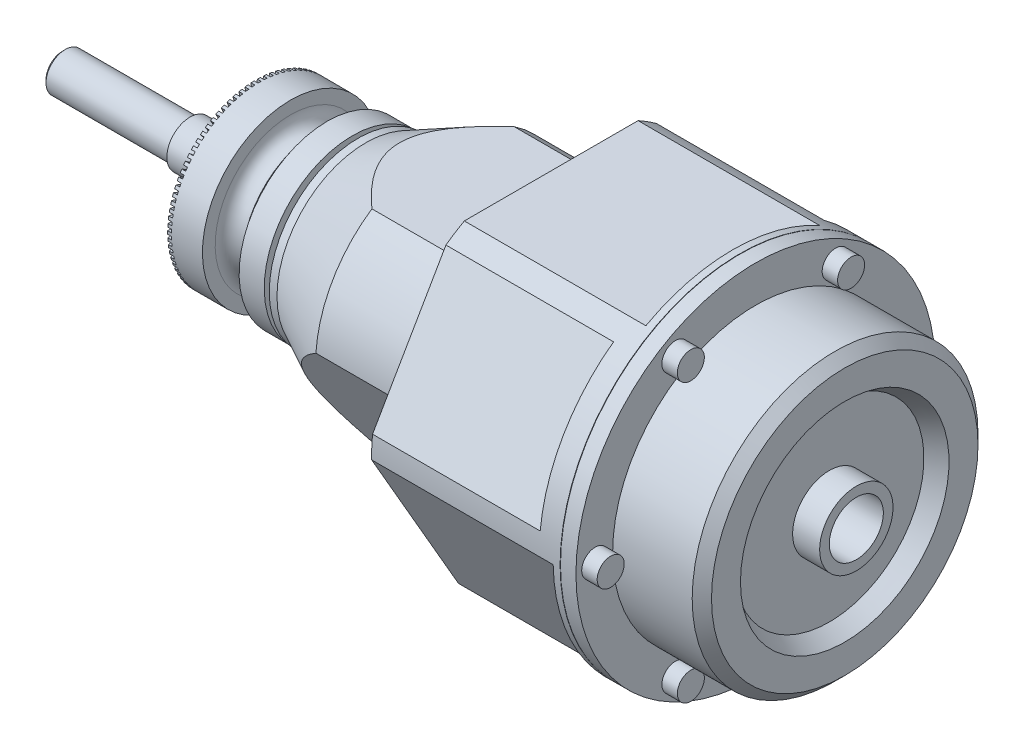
from build123d import *

# Parameters (mm, degrees)
ESQUISSE2_W                  = 0.1
ESQUISSE2_H                  = 5
ENL_V_START                  = -47
ENL_V_MAT_EXTRU_1_DEPTH      = 47
ENL_V_MAT_EXTRU_2_REACH      = 146.795
ENL_V_MAT_EXTRU_3_DEPTH      = 50
ENL_V_START_2                = -43.4
ENL_V_MAT_EXTRU_4_DEPTH      = 43.4
ESQUISSE8_R                  = 3.5
BOSS_EXTRU_1_DEPTH           = 4
BOSS_EXTRU_1_2_DEPTH         = 4
BOSS_EXTRU_1_3_DEPTH         = 4
BOSS_EXTRU_1_4_DEPTH         = 4
BOSS_EXTRU_1_5_DEPTH         = 4
BOSS_EXTRU_1_6_DEPTH         = 4
ESQUISSE9_R                  = 1.5
ENL_V_MAT_EXTRU_5_DEPTH      = 145.794682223
ENL_V_START_3                = -1
ENL_V_MAT_EXTRU_6_DEPTH      = 1
R_P_TITION_CIRCULAIRE1_COUNT = 90
CHANFREIN1_SIZE              = 0.7
ESQUISSE14_R                 = 7
ENL_V_MAT_EXTRU_7_DEPTH      = 10.7


with BuildPart() as part:
    # Esquisse1 → R_volution1 (revolve)
    with BuildSketch(Plane.XY, mode=Mode.PRIVATE) as r_volution1_sk:
        with BuildLine():
            Line((0, 0), (0, 23))
            Line((0, 23), (2, 23))
            Line((2, 23), (22, 33))
            Line((22, 33), (45, 33))
            ThreePointArc((45, 33), (48.535533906, 34.464466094), (50, 38))
            Line((50, 38), (50, 46.5))
            Line((50, 46.5), (102.9, 46.5))
            Line((102.9, 46.5), (102.9, 37))
            Line((102.9, 37), (123.5, 37))
            Line((123.5, 37), (126, 34.5))
            Line((126, 34.5), (126, 27))
            Line((126, 27), (122, 24.5))
            Line((122, 24.5), (122, 9.5))
            Line((122, 9.5), (129, 9.5))
            Line((129, 9.5), (129, 0))
            Line((129, 0), (0, 0))
        make_face()
    revolve(r_volution1_sk.sketch.rotate(Axis((0, 0, 0), (1, 0, 0)), 90), axis=Axis((0, 0, 0), (1, 0, 0)))

    # Esquisse2 → Enl_vement de mati_re-R_volution1 (revolve, cut)
    with BuildSketch(Plane.XY, mode=Mode.PRIVATE) as enl_vement_de_mati_re_r_volution1_sk:
        with Locations((98.85, 44)):
            Rectangle(ESQUISSE2_W, ESQUISSE2_H)
    revolve(enl_vement_de_mati_re_r_volution1_sk.sketch.rotate(Axis((0, 0, 0), (1, 0, 0)), 90), axis=Axis((0, 0, 0), (1, 0, 0)), mode=Mode.SUBTRACT)

    # Esquisse3 → Enl_v. mat.-Extru.1 (cut)
    with BuildSketch(Plane.ZY.offset(-50).offset(ENL_V_START)):
        with BuildLine():
            Line((22.491846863, 40.698486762), (-22.491846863, 40.698486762))
            ThreePointArc((-22.491846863, 40.698486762), (0, 46.5), (22.491846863, 40.698486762))
        make_face()
        with BuildLine():
            Line((46.491846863, -0.87073262), (24, -39.827754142))
            ThreePointArc((24, -39.827754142), (40.270181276, -23.25), (46.491846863, -0.87073262))
        make_face()
        with BuildLine():
            Line((-46.491846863, -0.87073262), (-24, -39.827754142))
            ThreePointArc((-24, -39.827754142), (-40.270181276, -23.25), (-46.491846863, -0.87073262))
        make_face()
    extrude(amount=ENL_V_MAT_EXTRU_1_DEPTH, mode=Mode.SUBTRACT)

    # Enl_v. mat.-Extru.2: up to this face of the body (flat: up to its plane)
    enl_v_mat_extru_2_end = Plane(part.part.faces().sort_by_distance((50, -0.423448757, 45.223161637))[0])
    # Esquisse4 → Enl_v. mat.-Extru.2 (cut, up to the picked face)
    with BuildSketch(Plane.ZY, mode=Mode.PRIVATE) as enl_v_mat_extru_2_sk1:
        with BuildLine():
            Line((-18.422212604, 27.379227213), (18.422212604, 27.379227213))
            ThreePointArc((18.422212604, 27.379227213), (0, 33), (-18.422212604, 27.379227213))
        make_face()
    enl_v_mat_extru_2_tool1 = split(extrude(enl_v_mat_extru_2_sk1.sketch, amount=-ENL_V_MAT_EXTRU_2_REACH, mode=Mode.PRIVATE), bisect_by=enl_v_mat_extru_2_end, keep=Keep.BOTH, mode=Mode.PRIVATE)
    # Esquisse4 → Enl_v. mat.-Extru.2 (cut, up to the picked face)
    with BuildSketch(Plane.ZY, mode=Mode.PRIVATE) as enl_v_mat_extru_2_sk2:
        with BuildLine():
            Line((32.922212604, 2.264490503), (14.5, -29.643717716))
            ThreePointArc((14.5, -29.643717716), (28.578838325, -16.5), (32.922212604, 2.264490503))
        make_face()
    enl_v_mat_extru_2_tool2 = split(extrude(enl_v_mat_extru_2_sk2.sketch, amount=-ENL_V_MAT_EXTRU_2_REACH, mode=Mode.PRIVATE), bisect_by=enl_v_mat_extru_2_end, keep=Keep.BOTH, mode=Mode.PRIVATE)
    # Esquisse4 → Enl_v. mat.-Extru.2 (cut, up to the picked face)
    with BuildSketch(Plane.ZY, mode=Mode.PRIVATE) as enl_v_mat_extru_2_sk3:
        with BuildLine():
            Line((-14.5, -29.643717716), (-32.922212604, 2.264490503))
            ThreePointArc((-32.922212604, 2.264490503), (-28.578838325, -16.5), (-14.5, -29.643717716))
        make_face()
    enl_v_mat_extru_2_tool3 = split(extrude(enl_v_mat_extru_2_sk3.sketch, amount=-ENL_V_MAT_EXTRU_2_REACH, mode=Mode.PRIVATE), bisect_by=enl_v_mat_extru_2_end, keep=Keep.BOTH, mode=Mode.PRIVATE)
    add(enl_v_mat_extru_2_tool1.solids().sort_by(Axis((0, 29.644801, 0), (1, 0, 0)))[0], mode=Mode.SUBTRACT)
    add(enl_v_mat_extru_2_tool2.solids().sort_by(Axis((0, -14.822401, 25.673151), (1, 0, 0)))[0], mode=Mode.SUBTRACT)
    add(enl_v_mat_extru_2_tool3.solids().sort_by(Axis((0, -14.822401, -25.673151), (1, 0, 0)))[0], mode=Mode.SUBTRACT)

    # Esquisse5 → Enl_v. mat.-Extru.3 (cut)
    with BuildSketch(Plane.ZY):
        with BuildLine():
            Line((-26.35105154, 27.379227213), (26.35105154, 27.379227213))
            ThreePointArc((26.35105154, 27.379227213), (0, 38), (-26.35105154, 27.379227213))
        make_face()
        with BuildLine():
            Line((10.535580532, -36.510293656), (36.886632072, 9.131066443))
            ThreePointArc((36.886632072, 9.131066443), (32.908965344, -19), (10.535580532, -36.510293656))
        make_face()
        with BuildLine():
            Line((-36.886632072, 9.131066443), (-10.535580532, -36.510293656))
            ThreePointArc((-10.535580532, -36.510293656), (-32.908965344, -19), (-36.886632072, 9.131066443))
        make_face()
    extrude(amount=-ENL_V_MAT_EXTRU_3_DEPTH, mode=Mode.SUBTRACT)

    # Esquisse6 → Enl_v. mat.-Extru.4 (cut)
    with BuildSketch(Plane.ZY.offset(-50).offset(ENL_V_START_2)):
        with BuildLine():
            Line((-27.255101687, 37.675050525), (-46.255101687, 4.766085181))
            ThreePointArc((-46.255101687, 4.766085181), (-40.270181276, 23.25), (-27.255101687, 37.675050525))
        make_face()
        with BuildLine():
            Line((-19, -42.441135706), (19, -42.441135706))
            ThreePointArc((19, -42.441135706), (0, -46.5), (-19, -42.441135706))
        make_face()
        with BuildLine():
            Line((46.255101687, 4.766085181), (27.255101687, 37.675050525))
            ThreePointArc((27.255101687, 37.675050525), (40.270181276, 23.25), (46.255101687, 4.766085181))
        make_face()
    extrude(amount=ENL_V_MAT_EXTRU_4_DEPTH, mode=Mode.SUBTRACT)

    # Esquisse7 → R_volution2 (revolve)
    with BuildSketch(Plane.XY):
        with BuildLine():
            Line((0, 20.3), (0, 0))
            Line((0, 0), (-76.5, 0))
            Line((-76.5, 0), (-76.5, 5))
            Line((-76.5, 5), (-43.5, 5))
            Line((-43.5, 5), (-43.5, 6))
            Line((-43.5, 6), (-26.5, 6))
            Line((-26.5, 6), (-26.5, 22.8))
            Line((-26.5, 22.8), (-17.5, 22.8))
            Line((-17.5, 22.8), (-17.5, 19.5))
            ThreePointArc((-17.5, 19.5), (-14, 16), (-10.5, 19.5))
            Line((-10.5, 19.5), (-10.5, 19.3))
            Line((-10.5, 19.3), (-8, 22.8))
            Line((-8, 22.8), (-1.5, 22.8))
            Line((-1.5, 22.8), (-1.5, 20.3))
            Line((-1.5, 20.3), (0, 20.3))
        make_face()
    revolve(axis=Axis((0, 0, 0), (-1, 0, 0)))

    # Esquisse9 → Enl_v. mat.-Extru.5 (cut, through all)
    with BuildSketch(Plane(origin=(0, 0, 0), x_dir=(1, 0, 0), z_dir=(0, 1, 0))):
        with Locations(Location((26, 0, 0), (0, 0, 270))):
            Circle(ESQUISSE9_R)
    extrude(amount=-ENL_V_MAT_EXTRU_5_DEPTH, mode=Mode.SUBTRACT)

    # Esquisse10 → Enl_v. mat.-Extru.6 (cut)
    with BuildSketch(Plane.ZY.offset(26.5).offset(ENL_V_START_3)):
        with BuildLine():
            Line((-0.191976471, 10.998324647), (-0.401405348, 22.996496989))
            ThreePointArc((-0.401405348, 22.996496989), (0, 23), (0.401405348, 22.996496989))
            Line((0.401405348, 22.996496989), (0.191976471, 10.998324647))
            ThreePointArc((0.191976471, 10.998324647), (0, 11), (-0.191976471, 10.998324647))
        make_face()
    enl_v_mat_extru_6 = extrude(amount=ENL_V_MAT_EXTRU_6_DEPTH, mode=Mode.SUBTRACT)

    # R_p_tition circulaire1: Enl_v. mat.-Extru.6 ×90 about axis
    r_p_tition_circulaire1_axis = Axis((0, 0, 0), (1, 0, 0))
    for i in range(1, R_P_TITION_CIRCULAIRE1_COUNT):
        add(enl_v_mat_extru_6.rotate(r_p_tition_circulaire1_axis, i * 360 / R_P_TITION_CIRCULAIRE1_COUNT), mode=Mode.SUBTRACT)

    # Chanfrein1
    chanfrein1_edges = [part.edges().sort_by_distance(p)[0] for p in [
        (-76.5, -5, 0),
    ]]
    chamfer(chanfrein1_edges, length=CHANFREIN1_SIZE)

    # Esquisse14 → Enl_v. mat.-Extru.7 (cut)
    with BuildSketch(Plane(origin=(129, 0, 0), x_dir=(0, 0, -1), z_dir=(1, 0, 0))):
        Circle(ESQUISSE14_R)
    extrude(amount=-ENL_V_MAT_EXTRU_7_DEPTH, mode=Mode.SUBTRACT)


with BuildPart() as body_2:
    # Esquisse8 → Boss.-Extru.1 (new body)
    with BuildSketch(Plane(origin=(102.9, 0, 0), x_dir=(0, 0, -1), z_dir=(1, 0, 0))):
        with Locations((-41.5, 0)):
            Circle(ESQUISSE8_R)
    extrude(amount=BOSS_EXTRU_1_DEPTH)


with BuildPart() as body_3:
    # Esquisse8 → Boss.-Extru.1 2 (new body)
    with BuildSketch(Plane(origin=(102.9, 0, 0), x_dir=(0, 0, -1), z_dir=(1, 0, 0))):
        with Locations((-20.75, 35.940054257)):
            Circle(ESQUISSE8_R)
    extrude(amount=BOSS_EXTRU_1_2_DEPTH)


with BuildPart() as body_4:
    # Esquisse8 → Boss.-Extru.1 3 (new body)
    with BuildSketch(Plane(origin=(102.9, 0, 0), x_dir=(0, 0, -1), z_dir=(1, 0, 0))):
        with Locations((20.75, 35.940054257)):
            Circle(ESQUISSE8_R)
    extrude(amount=BOSS_EXTRU_1_3_DEPTH)


with BuildPart() as body_5:
    # Esquisse8 → Boss.-Extru.1 4 (new body)
    with BuildSketch(Plane(origin=(102.9, 0, 0), x_dir=(0, 0, -1), z_dir=(1, 0, 0))):
        with Locations((41.5, 0)):
            Circle(ESQUISSE8_R)
    extrude(amount=BOSS_EXTRU_1_4_DEPTH)


with BuildPart() as body_6:
    # Esquisse8 → Boss.-Extru.1 5 (new body)
    with BuildSketch(Plane(origin=(102.9, 0, 0), x_dir=(0, 0, -1), z_dir=(1, 0, 0))):
        with Locations((20.75, -35.940054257)):
            Circle(ESQUISSE8_R)
    extrude(amount=BOSS_EXTRU_1_5_DEPTH)


with BuildPart() as body_7:
    # Esquisse8 → Boss.-Extru.1 6 (new body)
    with BuildSketch(Plane(origin=(102.9, 0, 0), x_dir=(0, 0, -1), z_dir=(1, 0, 0))):
        with Locations((-20.75, -35.940054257)):
            Circle(ESQUISSE8_R)
    extrude(amount=BOSS_EXTRU_1_6_DEPTH)


solid = Compound([part.part, body_2.part, body_3.part, body_4.part, body_5.part, body_6.part, body_7.part])
